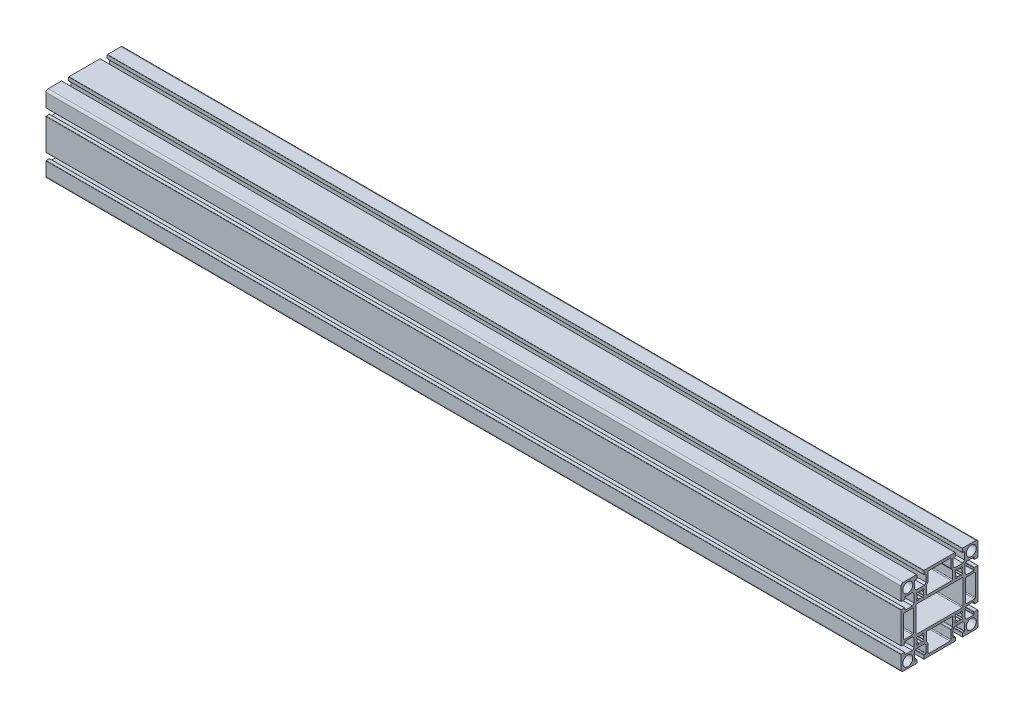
from build123d import *

# Parameters (mm, degrees)
MODEL8_R                             = 5.850002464
F_45_SARJA_1_0113_90X90_H_6M_1_DEPTH = 1000


with BuildPart() as part:
    # Model8 → 45-sarja 1.0113 90X90 H 6M_1 (new body)
    with BuildSketch(Plane(origin=(0, 0, 0), x_dir=(0, 0, -1), z_dir=(1, 0, 0))):
        with BuildLine():
            Line((41.000036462, 26.600022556), (44.70003763, 26.600026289))
            ThreePointArc((44.70003763, 26.600026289), (44.912145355, 26.687907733), (45, 26.900026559))
            Line((45, 26.900026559), (45, 42.500037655))
            ThreePointArc((45, 42.500037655), (44.267752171, 44.267780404), (42.499997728, 45))
            Line((42.499997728, 45), (26.900021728, 45))
            ThreePointArc((26.900021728, 45), (26.687889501, 44.912131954), (26.600021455, 44.699999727))
            Line((26.600021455, 44.699999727), (26.600017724, 40.999998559))
            ThreePointArc((26.600017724, 40.999998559), (26.746464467, 40.646444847), (27.100018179, 40.499998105))
            Line((27.100018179, 40.499998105), (29.000016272, 40.499998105))
            ThreePointArc((29.000016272, 40.499998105), (29.212150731, 40.41213128), (29.300019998, 40.199997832))
            Line((29.300019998, 40.199997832), (29.300019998, 31.699995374))
            Line((29.300019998, 31.699995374), (27.300026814, 29.699993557))
            Line((27.300026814, 29.699993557), (17.700016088, 29.699993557))
            Line((17.700016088, 29.699993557), (15.70001427, 31.699995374))
            Line((15.70001427, 31.699995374), (15.70001427, 40.2000061))
            ThreePointArc((15.70001427, 40.2000061), (15.787882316, 40.412138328), (16.000014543, 40.500006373))
            Line((16.000014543, 40.500006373), (17.90001727, 40.500006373))
            ThreePointArc((17.90001727, 40.500006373), (18.253570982, 40.646453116), (18.400017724, 41.000006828))
            Line((18.400017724, 41.000006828), (18.400021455, 44.699999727))
            ThreePointArc((18.400021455, 44.699999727), (18.31215341, 44.912131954), (18.100021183, 45))
            Line((18.100021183, 45), (-18.099979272, 45))
            ThreePointArc((-18.099979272, 45), (-18.312111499, 44.912131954), (-18.399979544, 44.699999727))
            Line((-18.399979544, 44.699999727), (-18.399983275, 40.999998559))
            ThreePointArc((-18.399983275, 40.999998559), (-18.253536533, 40.646444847), (-17.899982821, 40.499998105))
            Line((-17.899982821, 40.499998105), (-15.999983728, 40.499998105))
            ThreePointArc((-15.999983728, 40.499998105), (-15.787849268, 40.41213128), (-15.699980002, 40.199997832))
            Line((-15.699980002, 40.199997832), (-15.699980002, 31.699995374))
            Line((-15.699980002, 31.699995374), (-17.699976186, 29.699993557))
            Line((-17.699976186, 29.699993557), (-27.299982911, 29.699993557))
            Line((-27.299982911, 29.699993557), (-29.299985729, 31.699995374))
            Line((-29.299985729, 31.699995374), (-29.299985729, 40.2000061))
            ThreePointArc((-29.299985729, 40.2000061), (-29.212117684, 40.412138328), (-28.999985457, 40.500006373))
            Line((-28.999985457, 40.500006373), (-27.09998373, 40.500006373))
            ThreePointArc((-27.09998373, 40.500006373), (-26.746430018, 40.646453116), (-26.599983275, 41.000006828))
            Line((-26.599983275, 41.000006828), (-26.599979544, 44.699999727))
            ThreePointArc((-26.599979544, 44.699999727), (-26.68784759, 44.912131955), (-26.899979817, 45))
            Line((-26.899979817, 45), (-42.499997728, 45))
            ThreePointArc((-42.499997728, 45), (-44.267752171, 44.267780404), (-45, 42.500037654))
            Line((-45, 42.500037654), (-45, 26.900027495))
            ThreePointArc((-45, 26.900027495), (-44.912131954, 26.687895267), (-44.699999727, 26.600027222))
            Line((-44.699999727, 26.600027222), (-40.999998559, 26.600028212))
            ThreePointArc((-40.999998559, 26.600028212), (-40.646444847, 26.746474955), (-40.499998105, 27.100028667))
            Line((-40.499998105, 27.100028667), (-40.499998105, 29.000026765))
            ThreePointArc((-40.499998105, 29.000026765), (-40.41213128, 29.212161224), (-40.199997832, 29.30003049))
            Line((-40.199997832, 29.30003049), (-31.699995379, 29.30003049))
            Line((-31.699995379, 29.30003049), (-29.699993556, 27.300037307))
            Line((-29.699993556, 27.300037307), (-29.699993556, 17.700026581))
            Line((-29.699993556, 17.700026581), (-31.699995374, 15.700024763))
            Line((-31.699995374, 15.700024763), (-40.199995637, 15.700024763))
            ThreePointArc((-40.199995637, 15.700024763), (-40.412127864, 15.787892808), (-40.49999591, 16.000025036))
            Line((-40.49999591, 16.000025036), (-40.49999591, 17.900027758))
            ThreePointArc((-40.49999591, 17.900027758), (-40.646442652, 18.25358147), (-40.999996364, 18.400028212))
            Line((-40.999996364, 18.400028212), (-44.699999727, 18.400027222))
            ThreePointArc((-44.699999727, 18.400027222), (-44.912131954, 18.312159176), (-45, 18.100026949))
            Line((-45, 18.100026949), (-45, -18.100031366))
            ThreePointArc((-45, -18.100031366), (-44.912131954, -18.312163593), (-44.699999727, -18.400031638))
            Line((-44.699999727, -18.400031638), (-40.999996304, -18.400031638))
            ThreePointArc((-40.999996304, -18.400031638), (-40.64644405, -18.253584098), (-40.499998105, -17.900031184))
            Line((-40.499998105, -17.900031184), (-40.499998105, -16.000032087))
            ThreePointArc((-40.499998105, -16.000032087), (-40.41213128, -15.787897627), (-40.199997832, -15.700028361))
            Line((-40.199997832, -15.700028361), (-31.699995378, -15.700028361))
            Line((-31.699995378, -15.700028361), (-29.699993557, -17.700024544))
            Line((-29.699993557, -17.700024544), (-29.699993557, -27.30003127))
            Line((-29.699993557, -27.30003127), (-31.699995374, -29.300034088))
            Line((-31.699995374, -29.300034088), (-40.199995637, -29.300034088))
            ThreePointArc((-40.199995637, -29.300034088), (-40.412127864, -29.212166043), (-40.49999591, -29.000033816))
            Line((-40.49999591, -29.000033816), (-40.49999591, -27.100032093))
            ThreePointArc((-40.49999591, -27.100032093), (-40.646442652, -26.746478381), (-40.999996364, -26.600031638))
            Line((-40.999996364, -26.600031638), (-44.699999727, -26.600031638))
            ThreePointArc((-44.699999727, -26.600031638), (-44.912131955, -26.687899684), (-45, -26.900031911))
            Line((-45, -26.900031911), (-45, -42.500016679))
            ThreePointArc((-45, -42.500016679), (-44.267759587, -44.267772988), (-42.499997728, -45))
            Line((-42.499997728, -45), (-26.899981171, -45))
            ThreePointArc((-26.899981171, -45), (-26.687848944, -44.912131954), (-26.599980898, -44.699999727))
            Line((-26.599980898, -44.699999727), (-26.599983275, -41.000003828))
            ThreePointArc((-26.599983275, -41.000003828), (-26.746430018, -40.646450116), (-27.09998373, -40.500003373))
            Line((-27.09998373, -40.500003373), (-28.999985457, -40.500003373))
            ThreePointArc((-28.999985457, -40.500003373), (-29.212117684, -40.412135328), (-29.299985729, -40.200003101))
            Line((-29.299985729, -40.200003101), (-29.299985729, -31.699995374))
            Line((-29.299985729, -31.699995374), (-27.299982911, -29.699993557))
            Line((-27.299982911, -29.699993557), (-17.699976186, -29.699993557))
            Line((-17.699976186, -29.699993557), (-15.699980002, -31.699995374))
            Line((-15.699980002, -31.699995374), (-15.699980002, -40.199997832))
            ThreePointArc((-15.699980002, -40.199997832), (-15.787849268, -40.41213128), (-15.999983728, -40.499998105))
            Line((-15.999983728, -40.499998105), (-17.899982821, -40.499998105))
            ThreePointArc((-17.899982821, -40.499998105), (-18.253536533, -40.646444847), (-18.399983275, -40.999998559))
            Line((-18.399983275, -40.999998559), (-18.399980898, -44.699999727))
            ThreePointArc((-18.399980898, -44.699999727), (-18.312112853, -44.912131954), (-18.099980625, -45))
            Line((-18.099980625, -45), (18.100017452, -45))
            ThreePointArc((18.100017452, -45), (18.312149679, -44.912131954), (18.400017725, -44.699999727))
            Line((18.400017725, -44.699999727), (18.400017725, -40.999998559))
            ThreePointArc((18.400017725, -40.999998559), (18.253570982, -40.646444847), (17.90001727, -40.499998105))
            Line((17.90001727, -40.499998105), (16.000014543, -40.499998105))
            ThreePointArc((16.000014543, -40.499998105), (15.787882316, -40.412130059), (15.70001427, -40.199997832))
            Line((15.70001427, -40.199997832), (15.70001427, -31.699995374))
            Line((15.70001427, -31.699995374), (17.700016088, -29.699993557))
            Line((17.700016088, -29.699993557), (27.300026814, -29.699993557))
            Line((27.300026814, -29.699993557), (29.300019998, -31.699995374))
            Line((29.300019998, -31.699995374), (29.300019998, -40.199997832))
            ThreePointArc((29.300019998, -40.199997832), (29.212150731, -40.41213128), (29.000016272, -40.499998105))
            Line((29.000016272, -40.499998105), (27.100018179, -40.499998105))
            ThreePointArc((27.100018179, -40.499998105), (26.746464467, -40.646444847), (26.600017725, -40.999998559))
            Line((26.600017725, -40.999998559), (26.600017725, -44.699999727))
            ThreePointArc((26.600017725, -44.699999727), (26.68788577, -44.912131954), (26.900017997, -45))
            Line((26.900017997, -45), (42.499997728, -45))
            ThreePointArc((42.499997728, -45), (44.267759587, -44.267772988), (45, -42.500016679))
            Line((45, -42.500016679), (45, -26.900022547))
            ThreePointArc((45, -26.900022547), (44.912131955, -26.68789032), (44.699999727, -26.600022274))
            Line((44.699999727, -26.600022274), (41.000006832, -26.600026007))
            ThreePointArc((41.000006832, -26.600026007), (40.64645312, -26.74647275), (40.500006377, -27.100026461))
            Line((40.500006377, -27.100026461), (40.500006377, -29.000028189))
            ThreePointArc((40.500006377, -29.000028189), (40.412138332, -29.212160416), (40.200006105, -29.300028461))
            Line((40.200006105, -29.300028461), (31.699995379, -29.300028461))
            Line((31.699995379, -29.300028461), (29.699993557, -27.300031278))
            Line((29.699993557, -27.300031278), (29.699993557, -17.700024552))
            Line((29.699993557, -17.700024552), (31.699995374, -15.700022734))
            Line((31.699995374, -15.700022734), (40.199997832, -15.700022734))
            ThreePointArc((40.199997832, -15.700022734), (40.412130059, -15.787890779), (40.499998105, -16.000023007))
            Line((40.499998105, -16.000023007), (40.499998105, -17.900022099))
            ThreePointArc((40.499998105, -17.900022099), (40.646443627, -18.253578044), (40.999998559, -18.400026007))
            Line((40.999998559, -18.400026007), (44.699999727, -18.400022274))
            ThreePointArc((44.699999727, -18.400022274), (44.912131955, -18.312154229), (45, -18.100022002))
            Line((45, -18.100022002), (45, 18.100026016))
            ThreePointArc((45, 18.100026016), (44.912131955, 18.312158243), (44.699999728, 18.400026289))
            Line((44.699999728, 18.400026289), (41.000044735, 18.400022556))
            ThreePointArc((41.000044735, 18.400022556), (40.646491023, 18.253575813), (40.50004428, 17.900022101))
            Line((40.50004428, 17.900022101), (40.50004428, 16.000019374))
            ThreePointArc((40.50004428, 16.000019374), (40.412176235, 15.787887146), (40.200044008, 15.700019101))
            Line((40.200044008, 15.700019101), (31.700033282, 15.700019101))
            Line((31.700033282, 15.700019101), (29.700031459, 17.700012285))
            Line((29.700031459, 17.700012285), (29.700031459, 27.300023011))
            Line((29.700031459, 27.300023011), (31.700033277, 29.300024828))
            Line((31.700033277, 29.300024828), (40.200035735, 29.300024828))
            ThreePointArc((40.200035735, 29.300024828), (40.412167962, 29.212156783), (40.500036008, 29.000024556))
            Line((40.500036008, 29.000024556), (40.500036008, 27.100026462))
            ThreePointArc((40.500036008, 27.100026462), (40.64648153, 26.746470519), (41.000036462, 26.600022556))
        make_face()
        with Locations((-37.15, 37.15)):
            Circle(MODEL8_R, mode=Mode.SUBTRACT)
        with Locations((-37.15, -37.15)):
            Circle(MODEL8_R, mode=Mode.SUBTRACT)
        with Locations((37.15, -37.15)):
            Circle(MODEL8_R, mode=Mode.SUBTRACT)
        with Locations((37.15, 37.15)):
            Circle(MODEL8_R, mode=Mode.SUBTRACT)
        with BuildLine():
            Line((-13.499991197, 41.000017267), (-13.499991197, 31.202928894))
            ThreePointArc((-13.499991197, 31.202928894), (-13.576111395, 30.820246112), (-13.79288342, 30.495823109))
            Line((-13.79288342, 30.495823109), (-15.007098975, 29.281604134))
            ThreePointArc((-15.007098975, 29.281604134), (-15.223870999, 28.95718113), (-15.299991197, 28.574498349))
            Line((-15.299991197, 28.574498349), (-15.299991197, 19.299999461))
            ThreePointArc((-15.299991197, 19.299999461), (-15.007097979, 18.59289268), (-14.299991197, 18.299999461))
            Line((-14.299991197, 18.299999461), (14.300020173, 18.299999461))
            ThreePointArc((14.300020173, 18.299999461), (15.007126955, 18.59289268), (15.300020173, 19.299999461))
            Line((15.300020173, 19.299999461), (15.300020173, 28.574506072))
            ThreePointArc((15.300020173, 28.574506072), (15.223899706, 28.957189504), (15.007126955, 29.281612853))
            Line((15.007126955, 29.281612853), (13.792913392, 30.495826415))
            ThreePointArc((13.792913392, 30.495826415), (13.576140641, 30.820249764), (13.500020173, 31.202933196))
            Line((13.500020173, 31.202933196), (13.500020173, 41.000017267))
            ThreePointArc((13.500020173, 41.000017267), (13.207126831, 41.707124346), (12.500019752, 42.000017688))
            Line((12.500019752, 42.000017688), (-12.499990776, 42.000017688))
            ThreePointArc((-12.499990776, 42.000017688), (-13.207097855, 41.707124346), (-13.499991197, 41.000017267))
        make_face(mode=Mode.SUBTRACT)
        with BuildLine():
            Line((18.11593611, 19.105886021), (19.105886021, 18.11593611))
            ThreePointArc((19.105886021, 18.11593611), (19.318018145, 18.028068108), (19.530150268, 18.11593611))
            Line((19.530150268, 18.11593611), (20.550922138, 19.13670798))
            ThreePointArc((20.550922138, 19.13670798), (20.713308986, 19.220422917), (20.894144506, 19.194419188))
            ThreePointArc((20.894144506, 19.194419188), (22.5, 18.824998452), (24.105855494, 19.194419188))
            ThreePointArc((24.105855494, 19.194419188), (24.286691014, 19.220422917), (24.449077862, 19.13670798))
            Line((24.449077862, 19.13670798), (25.469849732, 18.11593611))
            ThreePointArc((25.469849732, 18.11593611), (25.681981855, 18.028068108), (25.894113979, 18.11593611))
            Line((25.894113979, 18.11593611), (26.88406389, 19.105886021))
            ThreePointArc((26.88406389, 19.105886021), (26.971931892, 19.318018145), (26.88406389, 19.530150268))
            Line((26.88406389, 19.530150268), (25.86329202, 20.550922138))
            ThreePointArc((25.86329202, 20.550922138), (25.779577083, 20.713308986), (25.805580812, 20.894144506))
            ThreePointArc((25.805580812, 20.894144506), (26.175001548, 22.5), (25.805580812, 24.105855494))
            ThreePointArc((25.805580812, 24.105855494), (25.779577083, 24.286691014), (25.86329202, 24.449077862))
            Line((25.86329202, 24.449077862), (26.88406389, 25.469849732))
            ThreePointArc((26.88406389, 25.469849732), (26.971931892, 25.681981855), (26.88406389, 25.894113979))
            Line((26.88406389, 25.894113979), (25.894113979, 26.88406389))
            ThreePointArc((25.894113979, 26.88406389), (25.681981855, 26.971931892), (25.469849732, 26.88406389))
            Line((25.469849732, 26.88406389), (24.449077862, 25.86329202))
            ThreePointArc((24.449077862, 25.86329202), (24.286691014, 25.779577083), (24.105855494, 25.805580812))
            ThreePointArc((24.105855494, 25.805580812), (22.5, 26.175001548), (20.894144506, 25.805580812))
            ThreePointArc((20.894144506, 25.805580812), (20.713308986, 25.779577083), (20.550922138, 25.86329202))
            Line((20.550922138, 25.86329202), (19.530150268, 26.88406389))
            ThreePointArc((19.530150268, 26.88406389), (19.318018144, 26.971931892), (19.105886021, 26.88406389))
            Line((19.105886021, 26.88406389), (18.11593611, 25.894113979))
            ThreePointArc((18.11593611, 25.894113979), (18.028068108, 25.681981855), (18.11593611, 25.469849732))
            Line((18.11593611, 25.469849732), (19.13670798, 24.449077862))
            ThreePointArc((19.13670798, 24.449077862), (19.220422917, 24.286691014), (19.194419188, 24.105855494))
            ThreePointArc((19.194419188, 24.105855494), (18.824998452, 22.5), (19.194419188, 20.894144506))
            ThreePointArc((19.194419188, 20.894144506), (19.220422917, 20.713308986), (19.13670798, 20.550922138))
            Line((19.13670798, 20.550922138), (18.11593611, 19.530150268))
            ThreePointArc((18.11593611, 19.530150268), (18.028068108, 19.318018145), (18.11593611, 19.105886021))
        make_face(mode=Mode.SUBTRACT)
        with BuildLine():
            Line((-26.88406389, 19.105886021), (-25.894113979, 18.11593611))
            ThreePointArc((-25.894113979, 18.11593611), (-25.681981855, 18.028068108), (-25.469849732, 18.11593611))
            Line((-25.469849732, 18.11593611), (-24.449077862, 19.13670798))
            ThreePointArc((-24.449077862, 19.13670798), (-24.286691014, 19.220422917), (-24.105855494, 19.194419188))
            ThreePointArc((-24.105855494, 19.194419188), (-22.5, 18.824998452), (-20.894144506, 19.194419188))
            ThreePointArc((-20.894144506, 19.194419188), (-20.713308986, 19.220422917), (-20.550922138, 19.13670798))
            Line((-20.550922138, 19.13670798), (-19.530150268, 18.11593611))
            ThreePointArc((-19.530150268, 18.11593611), (-19.318018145, 18.028068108), (-19.105886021, 18.11593611))
            Line((-19.105886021, 18.11593611), (-18.11593611, 19.105886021))
            ThreePointArc((-18.11593611, 19.105886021), (-18.028068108, 19.318018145), (-18.11593611, 19.530150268))
            Line((-18.11593611, 19.530150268), (-19.13670798, 20.550922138))
            ThreePointArc((-19.13670798, 20.550922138), (-19.220422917, 20.713308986), (-19.194419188, 20.894144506))
            ThreePointArc((-19.194419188, 20.894144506), (-18.824998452, 22.5), (-19.194419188, 24.105855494))
            ThreePointArc((-19.194419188, 24.105855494), (-19.220422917, 24.286691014), (-19.13670798, 24.449077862))
            Line((-19.13670798, 24.449077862), (-18.11593611, 25.469849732))
            ThreePointArc((-18.11593611, 25.469849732), (-18.028068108, 25.681981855), (-18.11593611, 25.894113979))
            Line((-18.11593611, 25.894113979), (-19.105886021, 26.88406389))
            ThreePointArc((-19.105886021, 26.88406389), (-19.318018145, 26.971931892), (-19.530150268, 26.88406389))
            Line((-19.530150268, 26.88406389), (-20.550922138, 25.86329202))
            ThreePointArc((-20.550922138, 25.86329202), (-20.713308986, 25.779577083), (-20.894144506, 25.805580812))
            ThreePointArc((-20.894144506, 25.805580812), (-22.5, 26.175001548), (-24.105855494, 25.805580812))
            ThreePointArc((-24.105855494, 25.805580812), (-24.286691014, 25.779577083), (-24.449077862, 25.86329202))
            Line((-24.449077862, 25.86329202), (-25.469849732, 26.88406389))
            ThreePointArc((-25.469849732, 26.88406389), (-25.681981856, 26.971931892), (-25.894113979, 26.88406389))
            Line((-25.894113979, 26.88406389), (-26.88406389, 25.894113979))
            ThreePointArc((-26.88406389, 25.894113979), (-26.971931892, 25.681981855), (-26.88406389, 25.469849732))
            Line((-26.88406389, 25.469849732), (-25.86329202, 24.449077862))
            ThreePointArc((-25.86329202, 24.449077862), (-25.779577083, 24.286691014), (-25.805580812, 24.105855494))
            ThreePointArc((-25.805580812, 24.105855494), (-26.175001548, 22.5), (-25.805580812, 20.894144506))
            ThreePointArc((-25.805580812, 20.894144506), (-25.779577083, 20.713308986), (-25.86329202, 20.550922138))
            Line((-25.86329202, 20.550922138), (-26.88406389, 19.530150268))
            ThreePointArc((-26.88406389, 19.530150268), (-26.971931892, 19.318018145), (-26.88406389, 19.105886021))
        make_face(mode=Mode.SUBTRACT)
        with BuildLine():
            Line((-27.499997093, 14.300053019), (-27.499997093, -14.300013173))
            ThreePointArc((-27.499997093, -14.300013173), (-27.207103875, -15.007119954), (-26.499997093, -15.300013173))
            Line((-26.499997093, -15.300013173), (26.500026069, -15.300013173))
            ThreePointArc((26.500026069, -15.300013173), (27.207132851, -15.007119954), (27.500026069, -14.300013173))
            Line((27.500026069, -14.300013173), (27.500026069, 14.300053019))
            ThreePointArc((27.500026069, 14.300053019), (27.207132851, 15.0071598), (26.500026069, 15.300053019))
            Line((26.500026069, 15.300053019), (-26.499997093, 15.300053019))
            ThreePointArc((-26.499997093, 15.300053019), (-27.207103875, 15.0071598), (-27.499997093, 14.300053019))
        make_face(mode=Mode.SUBTRACT)
        with BuildLine():
            Line((-42.000017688, 12.499997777), (-42.000017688, -12.500012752))
            ThreePointArc((-42.000017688, -12.500012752), (-41.707124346, -13.207119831), (-41.000017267, -13.500013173))
            Line((-41.000017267, -13.500013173), (-31.499998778, -13.500013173))
            ThreePointArc((-31.499998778, -13.500013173), (-30.792891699, -13.207119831), (-30.499998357, -12.500012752))
            Line((-30.499998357, -12.500012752), (-30.499998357, 12.499997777))
            ThreePointArc((-30.499998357, 12.499997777), (-30.792891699, 13.207104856), (-31.499998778, 13.499998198))
            Line((-31.499998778, 13.499998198), (-41.000017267, 13.499998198))
            ThreePointArc((-41.000017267, 13.499998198), (-41.707124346, 13.207104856), (-42.000017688, 12.499997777))
        make_face(mode=Mode.SUBTRACT)
        with BuildLine():
            Line((30.500027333, 12.499997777), (30.500027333, -12.500012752))
            ThreePointArc((30.500027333, -12.500012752), (30.792920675, -13.207119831), (31.500027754, -13.500013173))
            Line((31.500027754, -13.500013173), (41.000017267, -13.500013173))
            ThreePointArc((41.000017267, -13.500013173), (41.707124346, -13.207119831), (42.000017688, -12.500012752))
            Line((42.000017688, -12.500012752), (42.000017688, 12.499997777))
            ThreePointArc((42.000017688, 12.499997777), (41.707124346, 13.207104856), (41.000017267, 13.499998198))
            Line((41.000017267, 13.499998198), (31.500027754, 13.499998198))
            ThreePointArc((31.500027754, 13.499998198), (30.792920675, 13.207104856), (30.500027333, 12.499997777))
        make_face(mode=Mode.SUBTRACT)
        with BuildLine():
            Line((-13.499991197, -31.202928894), (-13.499991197, -41.000017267))
            ThreePointArc((-13.499991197, -41.000017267), (-13.207097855, -41.707124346), (-12.499990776, -42.000017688))
            Line((-12.499990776, -42.000017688), (12.500019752, -42.000017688))
            ThreePointArc((12.500019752, -42.000017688), (13.207126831, -41.707124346), (13.500020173, -41.000017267))
            Line((13.500020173, -41.000017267), (13.500020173, -31.202933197))
            ThreePointArc((13.500020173, -31.202933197), (13.576140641, -30.820249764), (13.792913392, -30.495826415))
            Line((13.792913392, -30.495826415), (15.007126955, -29.281612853))
            ThreePointArc((15.007126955, -29.281612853), (15.223899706, -28.957189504), (15.300020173, -28.574506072))
            Line((15.300020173, -28.574506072), (15.300020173, -19.300014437))
            ThreePointArc((15.300020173, -19.300014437), (15.007126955, -18.592907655), (14.300020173, -18.300014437))
            Line((14.300020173, -18.300014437), (-14.299991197, -18.300014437))
            ThreePointArc((-14.299991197, -18.300014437), (-15.007097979, -18.592907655), (-15.299991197, -19.300014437))
            Line((-15.299991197, -19.300014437), (-15.299991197, -28.574498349))
            ThreePointArc((-15.299991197, -28.574498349), (-15.223870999, -28.95718113), (-15.007098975, -29.281604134))
            Line((-15.007098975, -29.281604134), (-13.79288342, -30.495823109))
            ThreePointArc((-13.79288342, -30.495823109), (-13.576111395, -30.820246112), (-13.499991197, -31.202928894))
        make_face(mode=Mode.SUBTRACT)
        with BuildLine():
            Line((18.11593611, -25.894113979), (19.105886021, -26.88406389))
            ThreePointArc((19.105886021, -26.88406389), (19.318018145, -26.971931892), (19.530150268, -26.88406389))
            Line((19.530150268, -26.88406389), (20.550922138, -25.86329202))
            ThreePointArc((20.550922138, -25.86329202), (20.713308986, -25.779577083), (20.894144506, -25.805580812))
            ThreePointArc((20.894144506, -25.805580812), (22.5, -26.175001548), (24.105855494, -25.805580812))
            ThreePointArc((24.105855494, -25.805580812), (24.286691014, -25.779577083), (24.449077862, -25.86329202))
            Line((24.449077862, -25.86329202), (25.469849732, -26.88406389))
            ThreePointArc((25.469849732, -26.88406389), (25.681981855, -26.971931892), (25.894113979, -26.88406389))
            Line((25.894113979, -26.88406389), (26.88406389, -25.894113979))
            ThreePointArc((26.88406389, -25.894113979), (26.971931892, -25.681981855), (26.88406389, -25.469849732))
            Line((26.88406389, -25.469849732), (25.86329202, -24.449077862))
            ThreePointArc((25.86329202, -24.449077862), (25.779577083, -24.286691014), (25.805580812, -24.105855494))
            ThreePointArc((25.805580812, -24.105855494), (26.175001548, -22.5), (25.805580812, -20.894144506))
            ThreePointArc((25.805580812, -20.894144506), (25.779577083, -20.713308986), (25.86329202, -20.550922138))
            Line((25.86329202, -20.550922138), (26.88406389, -19.530150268))
            ThreePointArc((26.88406389, -19.530150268), (26.971931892, -19.318018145), (26.88406389, -19.105886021))
            Line((26.88406389, -19.105886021), (25.894113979, -18.11593611))
            ThreePointArc((25.894113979, -18.11593611), (25.681981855, -18.028068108), (25.469849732, -18.11593611))
            Line((25.469849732, -18.11593611), (24.449077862, -19.13670798))
            ThreePointArc((24.449077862, -19.13670798), (24.286691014, -19.220422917), (24.105855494, -19.194419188))
            ThreePointArc((24.105855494, -19.194419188), (22.5, -18.824998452), (20.894144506, -19.194419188))
            ThreePointArc((20.894144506, -19.194419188), (20.713308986, -19.220422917), (20.550922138, -19.13670798))
            Line((20.550922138, -19.13670798), (19.530150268, -18.11593611))
            ThreePointArc((19.530150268, -18.11593611), (19.318018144, -18.028068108), (19.105886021, -18.11593611))
            Line((19.105886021, -18.11593611), (18.11593611, -19.105886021))
            ThreePointArc((18.11593611, -19.105886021), (18.028068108, -19.318018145), (18.11593611, -19.530150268))
            Line((18.11593611, -19.530150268), (19.13670798, -20.550922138))
            ThreePointArc((19.13670798, -20.550922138), (19.220422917, -20.713308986), (19.194419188, -20.894144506))
            ThreePointArc((19.194419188, -20.894144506), (18.824998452, -22.5), (19.194419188, -24.105855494))
            ThreePointArc((19.194419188, -24.105855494), (19.220422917, -24.286691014), (19.13670798, -24.449077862))
            Line((19.13670798, -24.449077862), (18.11593611, -25.469849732))
            ThreePointArc((18.11593611, -25.469849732), (18.028068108, -25.681981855), (18.11593611, -25.894113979))
        make_face(mode=Mode.SUBTRACT)
        with BuildLine():
            Line((-26.88406389, -25.894113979), (-25.894113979, -26.88406389))
            ThreePointArc((-25.894113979, -26.88406389), (-25.681981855, -26.971931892), (-25.469849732, -26.88406389))
            Line((-25.469849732, -26.88406389), (-24.449077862, -25.86329202))
            ThreePointArc((-24.449077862, -25.86329202), (-24.286691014, -25.779577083), (-24.105855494, -25.805580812))
            ThreePointArc((-24.105855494, -25.805580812), (-22.5, -26.175001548), (-20.894144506, -25.805580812))
            ThreePointArc((-20.894144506, -25.805580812), (-20.713308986, -25.779577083), (-20.550922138, -25.86329202))
            Line((-20.550922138, -25.86329202), (-19.530150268, -26.88406389))
            ThreePointArc((-19.530150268, -26.88406389), (-19.318018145, -26.971931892), (-19.105886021, -26.88406389))
            Line((-19.105886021, -26.88406389), (-18.11593611, -25.894113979))
            ThreePointArc((-18.11593611, -25.894113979), (-18.028068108, -25.681981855), (-18.11593611, -25.469849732))
            Line((-18.11593611, -25.469849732), (-19.13670798, -24.449077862))
            ThreePointArc((-19.13670798, -24.449077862), (-19.220422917, -24.286691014), (-19.194419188, -24.105855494))
            ThreePointArc((-19.194419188, -24.105855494), (-18.824998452, -22.5), (-19.194419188, -20.894144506))
            ThreePointArc((-19.194419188, -20.894144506), (-19.220422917, -20.713308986), (-19.13670798, -20.550922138))
            Line((-19.13670798, -20.550922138), (-18.11593611, -19.530150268))
            ThreePointArc((-18.11593611, -19.530150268), (-18.028068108, -19.318018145), (-18.11593611, -19.105886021))
            Line((-18.11593611, -19.105886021), (-19.105886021, -18.11593611))
            ThreePointArc((-19.105886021, -18.11593611), (-19.318018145, -18.028068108), (-19.530150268, -18.11593611))
            Line((-19.530150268, -18.11593611), (-20.550922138, -19.13670798))
            ThreePointArc((-20.550922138, -19.13670798), (-20.713308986, -19.220422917), (-20.894144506, -19.194419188))
            ThreePointArc((-20.894144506, -19.194419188), (-22.5, -18.824998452), (-24.105855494, -19.194419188))
            ThreePointArc((-24.105855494, -19.194419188), (-24.286691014, -19.220422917), (-24.449077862, -19.13670798))
            Line((-24.449077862, -19.13670798), (-25.469849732, -18.11593611))
            ThreePointArc((-25.469849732, -18.11593611), (-25.681981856, -18.028068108), (-25.894113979, -18.11593611))
            Line((-25.894113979, -18.11593611), (-26.88406389, -19.105886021))
            ThreePointArc((-26.88406389, -19.105886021), (-26.971931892, -19.318018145), (-26.88406389, -19.530150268))
            Line((-26.88406389, -19.530150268), (-25.86329202, -20.550922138))
            ThreePointArc((-25.86329202, -20.550922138), (-25.779577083, -20.713308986), (-25.805580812, -20.894144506))
            ThreePointArc((-25.805580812, -20.894144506), (-26.175001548, -22.5), (-25.805580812, -24.105855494))
            ThreePointArc((-25.805580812, -24.105855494), (-25.779577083, -24.286691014), (-25.86329202, -24.449077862))
            Line((-25.86329202, -24.449077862), (-26.88406389, -25.469849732))
            ThreePointArc((-26.88406389, -25.469849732), (-26.971931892, -25.681981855), (-26.88406389, -25.894113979))
        make_face(mode=Mode.SUBTRACT)
    extrude(amount=F_45_SARJA_1_0113_90X90_H_6M_1_DEPTH)


solid = part.part
